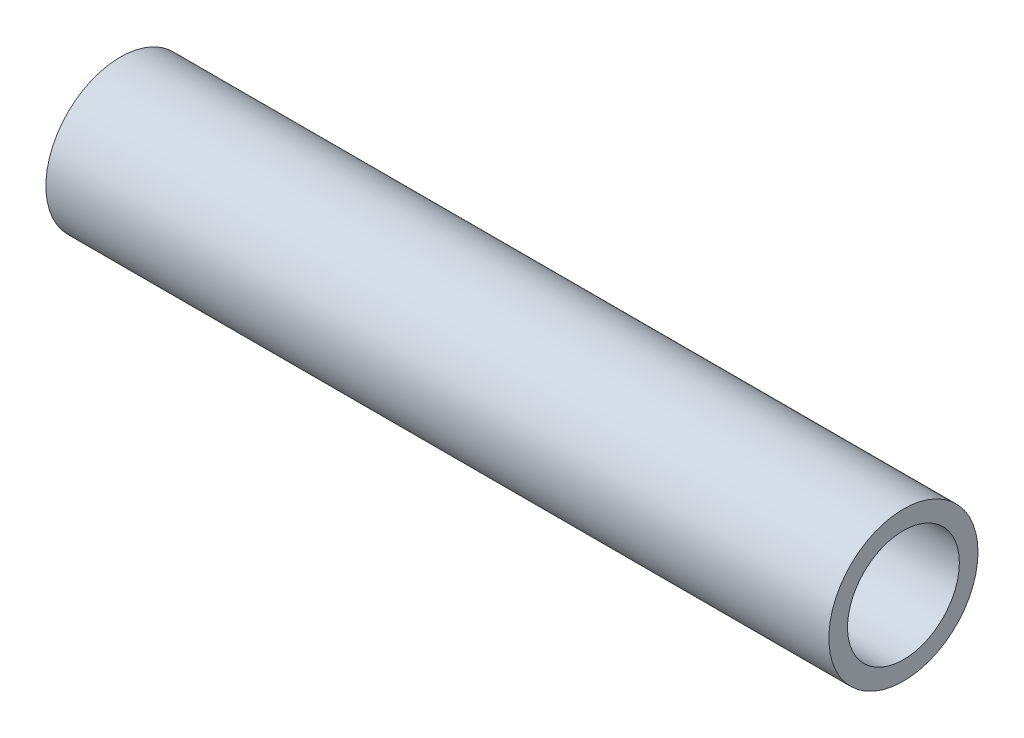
from build123d import *

# Parameters (mm, degrees)
ESQUISSE2_W = 42
ESQUISSE2_H = 1


with BuildPart() as part:
    # Esquisse2 → R_volution1 (revolve)
    with BuildSketch(Plane.XY, mode=Mode.PRIVATE) as r_volution1_sk:
        with Locations((-21, 3.5)):
            Rectangle(ESQUISSE2_W, ESQUISSE2_H)
    revolve(r_volution1_sk.sketch.rotate(Axis((0, 0, 0), (-1, 0, 0)), 90), axis=Axis((0, 0, 0), (-1, 0, 0)))


solid = part.part
